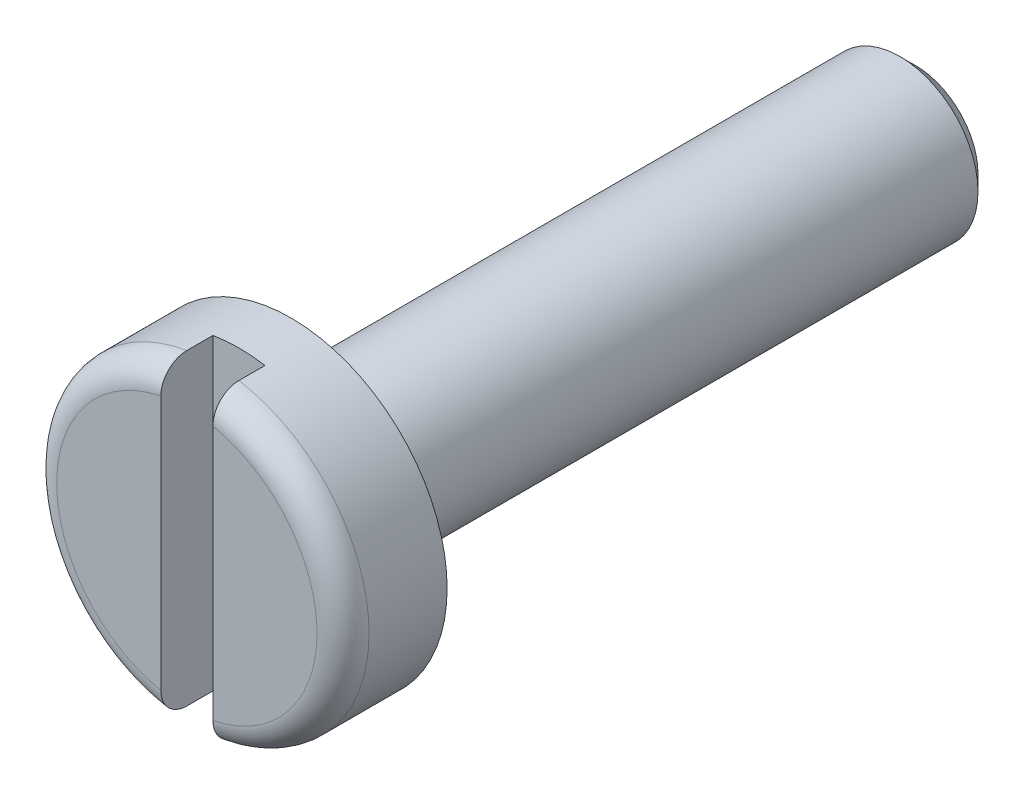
from build123d import *

# Parameters (mm, degrees)
ESQUISSE1_R             = 1.5
EXTRUSION1_DEPTH        = 12
ESQUISSE2_R             = 3
EXTRUSION2_DEPTH        = 2
CONG_1_R                = 0.5
CHANFREIN1_SIZE         = 0.3
ESQUISSE3_W             = 1
ESQUISSE3_H             = 6.610384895
ENL_V_MAT_EXTRU_1_DEPTH = 1


with BuildPart() as part:
    # Esquisse1 → Extrusion1 (new body)
    with BuildSketch(Plane.XY):
        Circle(ESQUISSE1_R)
    extrude(amount=EXTRUSION1_DEPTH)

    # Esquisse2 → Extrusion2 (add)
    with BuildSketch(Plane.XY.offset(12)):
        Circle(ESQUISSE2_R)
    extrude(amount=EXTRUSION2_DEPTH)

    # Cong_1
    cong_1_edges = [part.edges().sort_by_distance(p)[0] for p in [
        (-3, 0, 14),
    ]]
    fillet(cong_1_edges, radius=CONG_1_R)

    # Chanfrein1
    chanfrein1_edges = [part.edges().sort_by_distance(p)[0] for p in [
        (-1.5, 0, 0),
    ]]
    chamfer(chanfrein1_edges, length=CHANFREIN1_SIZE)

    # Esquisse3 → Enl_v. mat.-Extru.1 (cut)
    with BuildSketch(Plane.XY.offset(14)):
        with Locations((0, -0.076555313)):
            Rectangle(ESQUISSE3_W, ESQUISSE3_H)
    extrude(amount=-ENL_V_MAT_EXTRU_1_DEPTH, mode=Mode.SUBTRACT)


solid = part.part
